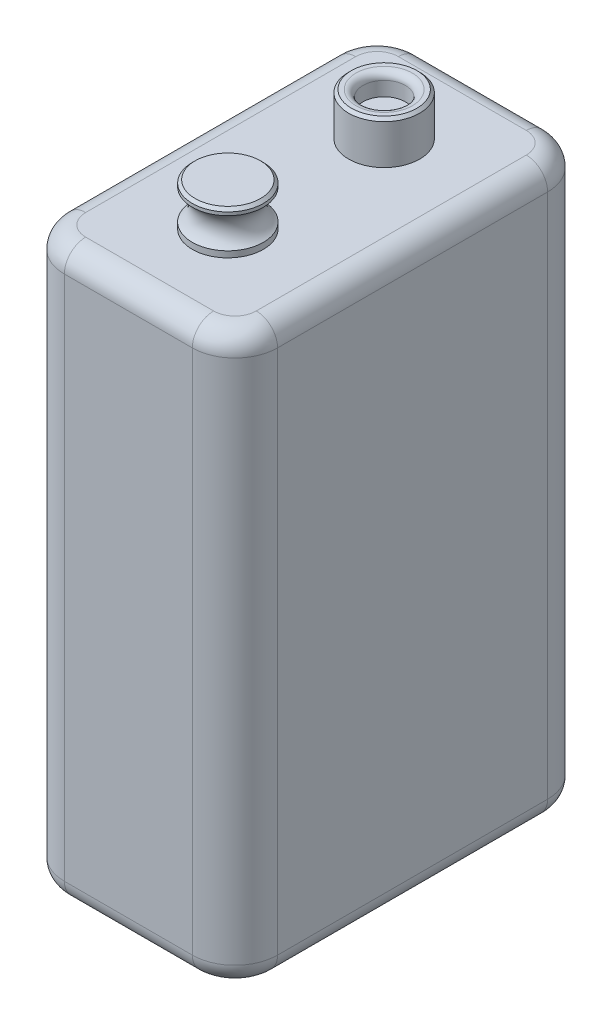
ISO-10303-21;
HEADER;
FILE_DESCRIPTION(('STEP AP214'),'2;1');
FILE_NAME('part.step','',(''),(''),'','','');
FILE_SCHEMA(('AUTOMOTIVE_DESIGN { 1 0 10303 214 1 1 1 1 }'));
ENDSEC;
DATA;
#1=APPLICATION_CONTEXT('core data for automotive mechanical design processes');
#2=APPLICATION_PROTOCOL_DEFINITION('international standard','automotive_design',2000,#1);
#3=PRODUCT_CONTEXT('',#1,'mechanical');
#4=PRODUCT('Part','Part','',(#3));
#5=PRODUCT_RELATED_PRODUCT_CATEGORY('part','',(#4));
#6=PRODUCT_DEFINITION_FORMATION('','',#4);
#7=PRODUCT_DEFINITION_CONTEXT('part definition',#1,'design');
#8=PRODUCT_DEFINITION('design','',#6,#7);
#9=PRODUCT_DEFINITION_SHAPE('','',#8);
#10=(LENGTH_UNIT() NAMED_UNIT(*) SI_UNIT(.MILLI.,.METRE.));
#11=(NAMED_UNIT(*) PLANE_ANGLE_UNIT() SI_UNIT($,.RADIAN.));
#12=(NAMED_UNIT(*) SI_UNIT($,.STERADIAN.) SOLID_ANGLE_UNIT());
#13=UNCERTAINTY_MEASURE_WITH_UNIT(LENGTH_MEASURE(1.E-05),#10,'distance_accuracy_value','');
#14=(GEOMETRIC_REPRESENTATION_CONTEXT(3) GLOBAL_UNCERTAINTY_ASSIGNED_CONTEXT((#13)) GLOBAL_UNIT_ASSIGNED_CONTEXT((#10,
#11,#12)) REPRESENTATION_CONTEXT('',''));
#15=CARTESIAN_POINT('',(0.,0.,0.));
#16=DIRECTION('',(0.,0.,1.));
#17=DIRECTION('',(1.,0.,0.));
#18=AXIS2_PLACEMENT_3D('',#15,#16,#17);
#19=CARTESIAN_POINT('',(0.,43.,5.49999999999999));
#20=DIRECTION('',(0.,-1.,0.));
#21=DIRECTION('',(0.,0.,-1.));
#22=AXIS2_PLACEMENT_3D('',#19,#20,#21);
#23=CYLINDRICAL_SURFACE('',#22,2.5);
#24=CARTESIAN_POINT('',(0.,40.,5.49999999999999));
#25=DIRECTION('',(0.,1.,0.));
#26=DIRECTION('',(0.,0.,-1.));
#27=AXIS2_PLACEMENT_3D('',#24,#25,#26);
#28=CIRCLE('',#27,2.5);
#29=CARTESIAN_POINT('',(0.,40.,2.99999999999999));
#30=VERTEX_POINT('',#29);
#31=EDGE_CURVE('E461',#30,#30,#28,.T.);
#32=ORIENTED_EDGE('',*,*,#31,.T.);
#33=EDGE_LOOP('',(#32));
#34=FACE_BOUND('',#33,.T.);
#35=CARTESIAN_POINT('',(0.,40.4314612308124,5.49999999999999));
#36=DIRECTION('',(0.,1.,0.));
#37=DIRECTION('',(0.,0.,1.));
#38=AXIS2_PLACEMENT_3D('',#35,#36,#37);
#39=CIRCLE('',#38,2.5);
#40=CARTESIAN_POINT('',(0.,40.4314612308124,7.99999999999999));
#41=VERTEX_POINT('',#40);
#42=EDGE_CURVE('E301',#41,#41,#39,.T.);
#43=ORIENTED_EDGE('',*,*,#42,.F.);
#44=EDGE_LOOP('',(#43));
#45=FACE_BOUND('',#44,.T.);
#46=ADVANCED_FACE('F41',(#34,#45),#23,.T.);
#47=CARTESIAN_POINT('',(7.5,40.,-12.5));
#48=DIRECTION('',(-1.,0.,0.));
#49=DIRECTION('',(0.,0.,1.));
#50=AXIS2_PLACEMENT_3D('',#47,#48,#49);
#51=PLANE('',#50);
#52=DIRECTION('',(0.,-1.,0.));
#53=VECTOR('',#52,1.);
#54=CARTESIAN_POINT('',(7.5,40.,-9.50000000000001));
#55=LINE('',#54,#53);
#56=CARTESIAN_POINT('',(7.5,1.5,-9.50000000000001));
#57=VERTEX_POINT('',#56);
#58=CARTESIAN_POINT('',(7.5,38.5,-9.50000000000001));
#59=VERTEX_POINT('',#58);
#60=EDGE_CURVE('E477',#57,#59,#55,.F.);
#61=ORIENTED_EDGE('',*,*,#60,.T.);
#62=DIRECTION('',(0.,0.,-1.));
#63=VECTOR('',#62,1.);
#64=CARTESIAN_POINT('',(7.5,38.5,9.49999999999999));
#65=LINE('',#64,#63);
#66=CARTESIAN_POINT('',(7.5,38.5,9.49999999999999));
#67=VERTEX_POINT('',#66);
#68=EDGE_CURVE('E265',#59,#67,#65,.F.);
#69=ORIENTED_EDGE('',*,*,#68,.T.);
#70=DIRECTION('',(0.,-1.,0.));
#71=VECTOR('',#70,1.);
#72=CARTESIAN_POINT('',(7.5,40.,9.49999999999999));
#73=LINE('',#72,#71);
#74=CARTESIAN_POINT('',(7.5,1.5,9.49999999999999));
#75=VERTEX_POINT('',#74);
#76=EDGE_CURVE('E475',#67,#75,#73,.T.);
#77=ORIENTED_EDGE('',*,*,#76,.T.);
#78=DIRECTION('',(0.,0.,-1.));
#79=VECTOR('',#78,1.);
#80=CARTESIAN_POINT('',(7.5,1.5,-12.5));
#81=LINE('',#80,#79);
#82=EDGE_CURVE('E216',#75,#57,#81,.T.);
#83=ORIENTED_EDGE('',*,*,#82,.T.);
#84=EDGE_LOOP('',(#61,#69,#77,#83));
#85=FACE_BOUND('',#84,.T.);
#86=ADVANCED_FACE('F322',(#85),#51,.F.);
#87=CARTESIAN_POINT('',(-7.5,40.,-12.5));
#88=DIRECTION('',(0.,0.,1.));
#89=DIRECTION('',(1.,0.,0.));
#90=AXIS2_PLACEMENT_3D('',#87,#88,#89);
#91=PLANE('',#90);
#92=DIRECTION('',(0.,-1.,0.));
#93=VECTOR('',#92,1.);
#94=CARTESIAN_POINT('',(-4.5,40.,-12.5));
#95=LINE('',#94,#93);
#96=CARTESIAN_POINT('',(-4.5,1.5,-12.5));
#97=VERTEX_POINT('',#96);
#98=CARTESIAN_POINT('',(-4.5,38.5,-12.5));
#99=VERTEX_POINT('',#98);
#100=EDGE_CURVE('E473',#97,#99,#95,.F.);
#101=ORIENTED_EDGE('',*,*,#100,.T.);
#102=DIRECTION('',(-1.,0.,0.));
#103=VECTOR('',#102,1.);
#104=CARTESIAN_POINT('',(4.5,38.5,-12.5));
#105=LINE('',#104,#103);
#106=CARTESIAN_POINT('',(4.5,38.5,-12.5));
#107=VERTEX_POINT('',#106);
#108=EDGE_CURVE('E64',#99,#107,#105,.F.);
#109=ORIENTED_EDGE('',*,*,#108,.T.);
#110=DIRECTION('',(0.,-1.,0.));
#111=VECTOR('',#110,1.);
#112=CARTESIAN_POINT('',(4.5,40.,-12.5));
#113=LINE('',#112,#111);
#114=CARTESIAN_POINT('',(4.5,1.5,-12.5));
#115=VERTEX_POINT('',#114);
#116=EDGE_CURVE('E471',#107,#115,#113,.T.);
#117=ORIENTED_EDGE('',*,*,#116,.T.);
#118=DIRECTION('',(-1.,0.,0.));
#119=VECTOR('',#118,1.);
#120=CARTESIAN_POINT('',(-7.5,1.5,-12.5));
#121=LINE('',#120,#119);
#122=EDGE_CURVE('E213',#115,#97,#121,.T.);
#123=ORIENTED_EDGE('',*,*,#122,.T.);
#124=EDGE_LOOP('',(#101,#109,#117,#123));
#125=FACE_BOUND('',#124,.T.);
#126=ADVANCED_FACE('F327',(#125),#91,.F.);
#127=CARTESIAN_POINT('',(-7.5,40.,-12.5));
#128=DIRECTION('',(1.,0.,0.));
#129=DIRECTION('',(0.,0.,-1.));
#130=AXIS2_PLACEMENT_3D('',#127,#128,#129);
#131=PLANE('',#130);
#132=DIRECTION('',(0.,-1.,0.));
#133=VECTOR('',#132,1.);
#134=CARTESIAN_POINT('',(-7.5,40.,9.49999999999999));
#135=LINE('',#134,#133);
#136=CARTESIAN_POINT('',(-7.5,1.5,9.49999999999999));
#137=VERTEX_POINT('',#136);
#138=CARTESIAN_POINT('',(-7.5,38.5,9.49999999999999));
#139=VERTEX_POINT('',#138);
#140=EDGE_CURVE('E235',#137,#139,#135,.F.);
#141=ORIENTED_EDGE('',*,*,#140,.T.);
#142=DIRECTION('',(0.,0.,1.));
#143=VECTOR('',#142,1.);
#144=CARTESIAN_POINT('',(-7.5,38.5,-9.50000000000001));
#145=LINE('',#144,#143);
#146=CARTESIAN_POINT('',(-7.5,38.5,-9.50000000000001));
#147=VERTEX_POINT('',#146);
#148=EDGE_CURVE('E259',#139,#147,#145,.F.);
#149=ORIENTED_EDGE('',*,*,#148,.T.);
#150=DIRECTION('',(0.,-1.,0.));
#151=VECTOR('',#150,1.);
#152=CARTESIAN_POINT('',(-7.5,40.,-9.50000000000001));
#153=LINE('',#152,#151);
#154=CARTESIAN_POINT('',(-7.5,1.5,-9.50000000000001));
#155=VERTEX_POINT('',#154);
#156=EDGE_CURVE('E469',#147,#155,#153,.T.);
#157=ORIENTED_EDGE('',*,*,#156,.T.);
#158=DIRECTION('',(0.,0.,1.));
#159=VECTOR('',#158,1.);
#160=CARTESIAN_POINT('',(-7.5,1.5,-12.5));
#161=LINE('',#160,#159);
#162=EDGE_CURVE('E208',#155,#137,#161,.T.);
#163=ORIENTED_EDGE('',*,*,#162,.T.);
#164=EDGE_LOOP('',(#141,#149,#157,#163));
#165=FACE_BOUND('',#164,.T.);
#166=ADVANCED_FACE('F355',(#165),#131,.F.);
#167=CARTESIAN_POINT('',(-7.5,40.,12.5));
#168=DIRECTION('',(0.,0.,-1.));
#169=DIRECTION('',(-1.,0.,0.));
#170=AXIS2_PLACEMENT_3D('',#167,#168,#169);
#171=PLANE('',#170);
#172=DIRECTION('',(0.,-1.,0.));
#173=VECTOR('',#172,1.);
#174=CARTESIAN_POINT('',(4.5,40.,12.5));
#175=LINE('',#174,#173);
#176=CARTESIAN_POINT('',(4.5,1.5,12.5));
#177=VERTEX_POINT('',#176);
#178=CARTESIAN_POINT('',(4.5,38.5,12.5));
#179=VERTEX_POINT('',#178);
#180=EDGE_CURVE('E185',#177,#179,#175,.F.);
#181=ORIENTED_EDGE('',*,*,#180,.T.);
#182=DIRECTION('',(1.,0.,0.));
#183=VECTOR('',#182,1.);
#184=CARTESIAN_POINT('',(-4.5,38.5,12.5));
#185=LINE('',#184,#183);
#186=CARTESIAN_POINT('',(-4.5,38.5,12.5));
#187=VERTEX_POINT('',#186);
#188=EDGE_CURVE('E255',#179,#187,#185,.F.);
#189=ORIENTED_EDGE('',*,*,#188,.T.);
#190=DIRECTION('',(0.,-1.,0.));
#191=VECTOR('',#190,1.);
#192=CARTESIAN_POINT('',(-4.5,40.,12.5));
#193=LINE('',#192,#191);
#194=CARTESIAN_POINT('',(-4.5,1.5,12.5));
#195=VERTEX_POINT('',#194);
#196=EDGE_CURVE('E183',#187,#195,#193,.T.);
#197=ORIENTED_EDGE('',*,*,#196,.T.);
#198=DIRECTION('',(1.,0.,0.));
#199=VECTOR('',#198,1.);
#200=CARTESIAN_POINT('',(-7.5,1.5,12.5));
#201=LINE('',#200,#199);
#202=EDGE_CURVE('E203',#195,#177,#201,.T.);
#203=ORIENTED_EDGE('',*,*,#202,.T.);
#204=EDGE_LOOP('',(#181,#189,#197,#203));
#205=FACE_BOUND('',#204,.T.);
#206=ADVANCED_FACE('F348',(#205),#171,.F.);
#207=CARTESIAN_POINT('',(0.,40.,0.));
#208=DIRECTION('',(0.,1.,0.));
#209=DIRECTION('',(0.,0.,1.));
#210=AXIS2_PLACEMENT_3D('',#207,#208,#209);
#211=PLANE('',#210);
#212=ORIENTED_EDGE('',*,*,#31,.F.);
#213=EDGE_LOOP('',(#212));
#214=FACE_BOUND('',#213,.T.);
#215=CARTESIAN_POINT('',(0.,40.,-5.5));
#216=DIRECTION('',(0.,1.,0.));
#217=DIRECTION('',(0.,0.,1.));
#218=AXIS2_PLACEMENT_3D('',#215,#216,#217);
#219=CIRCLE('',#218,2.5);
#220=CARTESIAN_POINT('',(0.,40.,-3.));
#221=VERTEX_POINT('',#220);
#222=EDGE_CURVE('E271',#221,#221,#219,.T.);
#223=ORIENTED_EDGE('',*,*,#222,.F.);
#224=EDGE_LOOP('',(#223));
#225=FACE_BOUND('',#224,.T.);
#226=DIRECTION('',(1.,0.,0.));
#227=VECTOR('',#226,1.);
#228=CARTESIAN_POINT('',(4.5,40.,11.));
#229=LINE('',#228,#227);
#230=CARTESIAN_POINT('',(-4.5,40.,11.));
#231=VERTEX_POINT('',#230);
#232=CARTESIAN_POINT('',(4.5,40.,11.));
#233=VERTEX_POINT('',#232);
#234=EDGE_CURVE('E247',#231,#233,#229,.T.);
#235=ORIENTED_EDGE('',*,*,#234,.T.);
#236=CARTESIAN_POINT('',(4.5,40.,9.49999999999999));
#237=DIRECTION('',(0.,1.,0.));
#238=DIRECTION('',(0.,0.,1.));
#239=AXIS2_PLACEMENT_3D('',#236,#237,#238);
#240=CIRCLE('',#239,1.5);
#241=CARTESIAN_POINT('',(6.,40.,9.49999999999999));
#242=VERTEX_POINT('',#241);
#243=EDGE_CURVE('E249',#233,#242,#240,.T.);
#244=ORIENTED_EDGE('',*,*,#243,.T.);
#245=DIRECTION('',(0.,0.,-1.));
#246=VECTOR('',#245,1.);
#247=CARTESIAN_POINT('',(6.,40.,-9.50000000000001));
#248=LINE('',#247,#246);
#249=CARTESIAN_POINT('',(6.,40.,-9.50000000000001));
#250=VERTEX_POINT('',#249);
#251=EDGE_CURVE('E218',#242,#250,#248,.T.);
#252=ORIENTED_EDGE('',*,*,#251,.T.);
#253=CARTESIAN_POINT('',(4.5,40.,-9.50000000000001));
#254=DIRECTION('',(0.,1.,0.));
#255=DIRECTION('',(0.,0.,1.));
#256=AXIS2_PLACEMENT_3D('',#253,#254,#255);
#257=CIRCLE('',#256,1.5);
#258=CARTESIAN_POINT('',(4.5,40.,-11.));
#259=VERTEX_POINT('',#258);
#260=EDGE_CURVE('E237',#250,#259,#257,.T.);
#261=ORIENTED_EDGE('',*,*,#260,.T.);
#262=DIRECTION('',(-1.,0.,0.));
#263=VECTOR('',#262,1.);
#264=CARTESIAN_POINT('',(-4.5,40.,-11.));
#265=LINE('',#264,#263);
#266=CARTESIAN_POINT('',(-4.5,40.,-11.));
#267=VERTEX_POINT('',#266);
#268=EDGE_CURVE('E239',#259,#267,#265,.T.);
#269=ORIENTED_EDGE('',*,*,#268,.T.);
#270=CARTESIAN_POINT('',(-4.5,40.,-9.50000000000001));
#271=DIRECTION('',(0.,1.,0.));
#272=DIRECTION('',(0.,0.,1.));
#273=AXIS2_PLACEMENT_3D('',#270,#271,#272);
#274=CIRCLE('',#273,1.5);
#275=CARTESIAN_POINT('',(-6.,40.,-9.50000000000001));
#276=VERTEX_POINT('',#275);
#277=EDGE_CURVE('E241',#267,#276,#274,.T.);
#278=ORIENTED_EDGE('',*,*,#277,.T.);
#279=DIRECTION('',(0.,0.,1.));
#280=VECTOR('',#279,1.);
#281=CARTESIAN_POINT('',(-6.,40.,9.49999999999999));
#282=LINE('',#281,#280);
#283=CARTESIAN_POINT('',(-6.,40.,9.49999999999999));
#284=VERTEX_POINT('',#283);
#285=EDGE_CURVE('E243',#276,#284,#282,.T.);
#286=ORIENTED_EDGE('',*,*,#285,.T.);
#287=CARTESIAN_POINT('',(-4.5,40.,9.49999999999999));
#288=DIRECTION('',(0.,1.,0.));
#289=DIRECTION('',(0.,0.,1.));
#290=AXIS2_PLACEMENT_3D('',#287,#288,#289);
#291=CIRCLE('',#290,1.5);
#292=EDGE_CURVE('E245',#284,#231,#291,.T.);
#293=ORIENTED_EDGE('',*,*,#292,.T.);
#294=EDGE_LOOP('',(#235,#244,#252,#261,#269,#278,#286,#293));
#295=FACE_BOUND('',#294,.T.);
#296=ADVANCED_FACE('F345',(#214,#225,#295),#211,.T.);
#297=CARTESIAN_POINT('',(0.,0.,0.));
#298=DIRECTION('',(0.,1.,0.));
#299=DIRECTION('',(0.,0.,1.));
#300=AXIS2_PLACEMENT_3D('',#297,#298,#299);
#301=PLANE('',#300);
#302=DIRECTION('',(0.,0.,-1.));
#303=VECTOR('',#302,1.);
#304=CARTESIAN_POINT('',(6.,0.,0.));
#305=LINE('',#304,#303);
#306=CARTESIAN_POINT('',(6.,0.,-9.50000000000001));
#307=VERTEX_POINT('',#306);
#308=CARTESIAN_POINT('',(6.,0.,9.49999999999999));
#309=VERTEX_POINT('',#308);
#310=EDGE_CURVE('E160',#307,#309,#305,.F.);
#311=ORIENTED_EDGE('',*,*,#310,.T.);
#312=CARTESIAN_POINT('',(4.5,0.,9.49999999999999));
#313=DIRECTION('',(0.,1.,0.));
#314=DIRECTION('',(0.,0.,1.));
#315=AXIS2_PLACEMENT_3D('',#312,#313,#314);
#316=CIRCLE('',#315,1.5);
#317=CARTESIAN_POINT('',(4.5,0.,11.));
#318=VERTEX_POINT('',#317);
#319=EDGE_CURVE('E198',#309,#318,#316,.F.);
#320=ORIENTED_EDGE('',*,*,#319,.T.);
#321=DIRECTION('',(1.,0.,0.));
#322=VECTOR('',#321,1.);
#323=CARTESIAN_POINT('',(0.,0.,11.));
#324=LINE('',#323,#322);
#325=CARTESIAN_POINT('',(-4.5,0.,11.));
#326=VERTEX_POINT('',#325);
#327=EDGE_CURVE('E196',#318,#326,#324,.F.);
#328=ORIENTED_EDGE('',*,*,#327,.T.);
#329=CARTESIAN_POINT('',(-4.5,0.,9.49999999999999));
#330=DIRECTION('',(0.,1.,0.));
#331=DIRECTION('',(0.,0.,1.));
#332=AXIS2_PLACEMENT_3D('',#329,#330,#331);
#333=CIRCLE('',#332,1.5);
#334=CARTESIAN_POINT('',(-6.,0.,9.49999999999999));
#335=VERTEX_POINT('',#334);
#336=EDGE_CURVE('E194',#326,#335,#333,.F.);
#337=ORIENTED_EDGE('',*,*,#336,.T.);
#338=DIRECTION('',(0.,0.,1.));
#339=VECTOR('',#338,1.);
#340=CARTESIAN_POINT('',(-6.,0.,0.));
#341=LINE('',#340,#339);
#342=CARTESIAN_POINT('',(-6.,0.,-9.50000000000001));
#343=VERTEX_POINT('',#342);
#344=EDGE_CURVE('E192',#335,#343,#341,.F.);
#345=ORIENTED_EDGE('',*,*,#344,.T.);
#346=CARTESIAN_POINT('',(-4.5,0.,-9.50000000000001));
#347=DIRECTION('',(0.,1.,0.));
#348=DIRECTION('',(0.,0.,1.));
#349=AXIS2_PLACEMENT_3D('',#346,#347,#348);
#350=CIRCLE('',#349,1.5);
#351=CARTESIAN_POINT('',(-4.5,0.,-11.));
#352=VERTEX_POINT('',#351);
#353=EDGE_CURVE('E190',#343,#352,#350,.F.);
#354=ORIENTED_EDGE('',*,*,#353,.T.);
#355=DIRECTION('',(-1.,0.,0.));
#356=VECTOR('',#355,1.);
#357=CARTESIAN_POINT('',(0.,0.,-11.));
#358=LINE('',#357,#356);
#359=CARTESIAN_POINT('',(4.5,0.,-11.));
#360=VERTEX_POINT('',#359);
#361=EDGE_CURVE('E163',#352,#360,#358,.F.);
#362=ORIENTED_EDGE('',*,*,#361,.T.);
#363=CARTESIAN_POINT('',(4.5,0.,-9.50000000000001));
#364=DIRECTION('',(0.,1.,0.));
#365=DIRECTION('',(0.,0.,1.));
#366=AXIS2_PLACEMENT_3D('',#363,#364,#365);
#367=CIRCLE('',#366,1.5);
#368=EDGE_CURVE('E155',#360,#307,#367,.F.);
#369=ORIENTED_EDGE('',*,*,#368,.T.);
#370=EDGE_LOOP('',(#311,#320,#328,#337,#345,#354,#362,#369));
#371=FACE_BOUND('',#370,.T.);
#372=ADVANCED_FACE('F157',(#371),#301,.F.);
#373=CARTESIAN_POINT('',(-4.5,40.,-9.50000000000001));
#374=DIRECTION('',(0.,-1.,0.));
#375=DIRECTION('',(0.,0.,-1.));
#376=AXIS2_PLACEMENT_3D('',#373,#374,#375);
#377=CYLINDRICAL_SURFACE('',#376,3.);
#378=ORIENTED_EDGE('',*,*,#156,.F.);
#379=CARTESIAN_POINT('',(-4.5,38.5,-9.50000000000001));
#380=DIRECTION('',(0.,1.,0.));
#381=DIRECTION('',(0.,0.,1.));
#382=AXIS2_PLACEMENT_3D('',#379,#380,#381);
#383=CIRCLE('',#382,3.);
#384=EDGE_CURVE('E261',#147,#99,#383,.F.);
#385=ORIENTED_EDGE('',*,*,#384,.T.);
#386=ORIENTED_EDGE('',*,*,#100,.F.);
#387=CARTESIAN_POINT('',(-4.5,1.5,-9.50000000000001));
#388=DIRECTION('',(0.,1.,0.));
#389=DIRECTION('',(0.,0.,1.));
#390=AXIS2_PLACEMENT_3D('',#387,#388,#389);
#391=CIRCLE('',#390,3.);
#392=EDGE_CURVE('E210',#97,#155,#391,.T.);
#393=ORIENTED_EDGE('',*,*,#392,.T.);
#394=EDGE_LOOP('',(#378,#385,#386,#393));
#395=FACE_BOUND('',#394,.T.);
#396=ADVANCED_FACE('F352',(#395),#377,.T.);
#397=CARTESIAN_POINT('',(4.5,40.,-9.50000000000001));
#398=DIRECTION('',(0.,-1.,0.));
#399=DIRECTION('',(0.,0.,-1.));
#400=AXIS2_PLACEMENT_3D('',#397,#398,#399);
#401=CYLINDRICAL_SURFACE('',#400,3.);
#402=ORIENTED_EDGE('',*,*,#116,.F.);
#403=CARTESIAN_POINT('',(4.5,38.5,-9.50000000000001));
#404=DIRECTION('',(0.,1.,0.));
#405=DIRECTION('',(0.,0.,1.));
#406=AXIS2_PLACEMENT_3D('',#403,#404,#405);
#407=CIRCLE('',#406,3.);
#408=EDGE_CURVE('E56',#107,#59,#407,.F.);
#409=ORIENTED_EDGE('',*,*,#408,.T.);
#410=ORIENTED_EDGE('',*,*,#60,.F.);
#411=CARTESIAN_POINT('',(4.5,1.5,-9.50000000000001));
#412=DIRECTION('',(0.,1.,0.));
#413=DIRECTION('',(0.,0.,1.));
#414=AXIS2_PLACEMENT_3D('',#411,#412,#413);
#415=CIRCLE('',#414,3.);
#416=EDGE_CURVE('E173',#57,#115,#415,.T.);
#417=ORIENTED_EDGE('',*,*,#416,.T.);
#418=EDGE_LOOP('',(#402,#409,#410,#417));
#419=FACE_BOUND('',#418,.T.);
#420=ADVANCED_FACE('F364',(#419),#401,.T.);
#421=CARTESIAN_POINT('',(-4.5,40.,9.49999999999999));
#422=DIRECTION('',(0.,-1.,0.));
#423=DIRECTION('',(0.,0.,-1.));
#424=AXIS2_PLACEMENT_3D('',#421,#422,#423);
#425=CYLINDRICAL_SURFACE('',#424,3.);
#426=ORIENTED_EDGE('',*,*,#196,.F.);
#427=CARTESIAN_POINT('',(-4.5,38.5,9.49999999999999));
#428=DIRECTION('',(0.,1.,0.));
#429=DIRECTION('',(0.,0.,1.));
#430=AXIS2_PLACEMENT_3D('',#427,#428,#429);
#431=CIRCLE('',#430,3.);
#432=EDGE_CURVE('E257',#187,#139,#431,.F.);
#433=ORIENTED_EDGE('',*,*,#432,.T.);
#434=ORIENTED_EDGE('',*,*,#140,.F.);
#435=CARTESIAN_POINT('',(-4.5,1.5,9.49999999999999));
#436=DIRECTION('',(0.,1.,0.));
#437=DIRECTION('',(0.,0.,1.));
#438=AXIS2_PLACEMENT_3D('',#435,#436,#437);
#439=CIRCLE('',#438,3.);
#440=EDGE_CURVE('E205',#137,#195,#439,.T.);
#441=ORIENTED_EDGE('',*,*,#440,.T.);
#442=EDGE_LOOP('',(#426,#433,#434,#441));
#443=FACE_BOUND('',#442,.T.);
#444=ADVANCED_FACE('F368',(#443),#425,.T.);
#445=CARTESIAN_POINT('',(4.5,40.,9.49999999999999));
#446=DIRECTION('',(0.,-1.,0.));
#447=DIRECTION('',(0.,0.,-1.));
#448=AXIS2_PLACEMENT_3D('',#445,#446,#447);
#449=CYLINDRICAL_SURFACE('',#448,3.);
#450=ORIENTED_EDGE('',*,*,#76,.F.);
#451=CARTESIAN_POINT('',(4.5,38.5,9.49999999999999));
#452=DIRECTION('',(0.,1.,0.));
#453=DIRECTION('',(0.,0.,1.));
#454=AXIS2_PLACEMENT_3D('',#451,#452,#453);
#455=CIRCLE('',#454,3.);
#456=EDGE_CURVE('E252',#67,#179,#455,.F.);
#457=ORIENTED_EDGE('',*,*,#456,.T.);
#458=ORIENTED_EDGE('',*,*,#180,.F.);
#459=CARTESIAN_POINT('',(4.5,1.5,9.49999999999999));
#460=DIRECTION('',(0.,1.,0.));
#461=DIRECTION('',(0.,0.,1.));
#462=AXIS2_PLACEMENT_3D('',#459,#460,#461);
#463=CIRCLE('',#462,3.);
#464=EDGE_CURVE('E200',#177,#75,#463,.T.);
#465=ORIENTED_EDGE('',*,*,#464,.T.);
#466=EDGE_LOOP('',(#450,#457,#458,#465));
#467=FACE_BOUND('',#466,.T.);
#468=ADVANCED_FACE('F371',(#467),#449,.T.);
#469=CARTESIAN_POINT('',(-4.5,1.5,-9.50000000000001));
#470=DIRECTION('',(0.,1.,0.));
#471=DIRECTION('',(0.,0.,1.));
#472=AXIS2_PLACEMENT_3D('',#469,#470,#471);
#473=DEGENERATE_TOROIDAL_SURFACE('',#472,1.5,1.5,.T.);
#474=CARTESIAN_POINT('',(-6.,1.5,-9.50000000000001));
#475=DIRECTION('',(0.,0.,1.));
#476=DIRECTION('',(1.,0.,0.));
#477=AXIS2_PLACEMENT_3D('',#474,#475,#476);
#478=CIRCLE('',#477,1.5);
#479=EDGE_CURVE('E229',#155,#343,#478,.T.);
#480=ORIENTED_EDGE('',*,*,#479,.F.);
#481=ORIENTED_EDGE('',*,*,#392,.F.);
#482=CARTESIAN_POINT('',(-4.5,1.5,-11.));
#483=DIRECTION('',(1.,0.,0.));
#484=DIRECTION('',(0.,0.,-1.));
#485=AXIS2_PLACEMENT_3D('',#482,#483,#484);
#486=CIRCLE('',#485,1.5);
#487=EDGE_CURVE('E232',#352,#97,#486,.T.);
#488=ORIENTED_EDGE('',*,*,#487,.F.);
#489=ORIENTED_EDGE('',*,*,#353,.F.);
#490=EDGE_LOOP('',(#480,#481,#488,#489));
#491=FACE_BOUND('',#490,.T.);
#492=ADVANCED_FACE('F375',(#491),#473,.T.);
#493=CARTESIAN_POINT('',(-7.5,1.5,-11.));
#494=DIRECTION('',(-1.,0.,0.));
#495=DIRECTION('',(0.,0.,1.));
#496=AXIS2_PLACEMENT_3D('',#493,#494,#495);
#497=CYLINDRICAL_SURFACE('',#496,1.5);
#498=ORIENTED_EDGE('',*,*,#487,.T.);
#499=ORIENTED_EDGE('',*,*,#122,.F.);
#500=CARTESIAN_POINT('',(4.5,1.5,-11.));
#501=DIRECTION('',(1.,0.,0.));
#502=DIRECTION('',(0.,0.,-1.));
#503=AXIS2_PLACEMENT_3D('',#500,#501,#502);
#504=CIRCLE('',#503,1.5);
#505=EDGE_CURVE('E227',#360,#115,#504,.T.);
#506=ORIENTED_EDGE('',*,*,#505,.F.);
#507=ORIENTED_EDGE('',*,*,#361,.F.);
#508=EDGE_LOOP('',(#498,#499,#506,#507));
#509=FACE_BOUND('',#508,.T.);
#510=ADVANCED_FACE('F397',(#509),#497,.T.);
#511=CARTESIAN_POINT('',(-6.,1.5,-12.5));
#512=DIRECTION('',(0.,0.,1.));
#513=DIRECTION('',(1.,0.,0.));
#514=AXIS2_PLACEMENT_3D('',#511,#512,#513);
#515=CYLINDRICAL_SURFACE('',#514,1.5);
#516=ORIENTED_EDGE('',*,*,#479,.T.);
#517=ORIENTED_EDGE('',*,*,#344,.F.);
#518=CARTESIAN_POINT('',(-6.,1.5,9.49999999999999));
#519=DIRECTION('',(0.,0.,1.));
#520=DIRECTION('',(1.,0.,0.));
#521=AXIS2_PLACEMENT_3D('',#518,#519,#520);
#522=CIRCLE('',#521,1.5);
#523=EDGE_CURVE('E176',#137,#335,#522,.T.);
#524=ORIENTED_EDGE('',*,*,#523,.F.);
#525=ORIENTED_EDGE('',*,*,#162,.F.);
#526=EDGE_LOOP('',(#516,#517,#524,#525));
#527=FACE_BOUND('',#526,.T.);
#528=ADVANCED_FACE('F394',(#527),#515,.T.);
#529=CARTESIAN_POINT('',(4.5,1.5,-9.50000000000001));
#530=DIRECTION('',(0.,1.,0.));
#531=DIRECTION('',(0.,0.,1.));
#532=AXIS2_PLACEMENT_3D('',#529,#530,#531);
#533=DEGENERATE_TOROIDAL_SURFACE('',#532,1.5,1.5,.T.);
#534=ORIENTED_EDGE('',*,*,#505,.T.);
#535=ORIENTED_EDGE('',*,*,#416,.F.);
#536=CARTESIAN_POINT('',(6.,1.5,-9.50000000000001));
#537=DIRECTION('',(0.,0.,1.));
#538=DIRECTION('',(1.,0.,0.));
#539=AXIS2_PLACEMENT_3D('',#536,#537,#538);
#540=CIRCLE('',#539,1.5);
#541=EDGE_CURVE('E170',#307,#57,#540,.T.);
#542=ORIENTED_EDGE('',*,*,#541,.F.);
#543=ORIENTED_EDGE('',*,*,#368,.F.);
#544=EDGE_LOOP('',(#534,#535,#542,#543));
#545=FACE_BOUND('',#544,.T.);
#546=ADVANCED_FACE('F171',(#545),#533,.T.);
#547=CARTESIAN_POINT('',(-4.5,1.5,9.49999999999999));
#548=DIRECTION('',(0.,1.,0.));
#549=DIRECTION('',(0.,0.,1.));
#550=AXIS2_PLACEMENT_3D('',#547,#548,#549);
#551=DEGENERATE_TOROIDAL_SURFACE('',#550,1.5,1.5,.T.);
#552=ORIENTED_EDGE('',*,*,#523,.T.);
#553=ORIENTED_EDGE('',*,*,#336,.F.);
#554=CARTESIAN_POINT('',(-4.5,1.5,11.));
#555=DIRECTION('',(1.,0.,0.));
#556=DIRECTION('',(0.,0.,-1.));
#557=AXIS2_PLACEMENT_3D('',#554,#555,#556);
#558=CIRCLE('',#557,1.5);
#559=EDGE_CURVE('E177',#195,#326,#558,.T.);
#560=ORIENTED_EDGE('',*,*,#559,.F.);
#561=ORIENTED_EDGE('',*,*,#440,.F.);
#562=EDGE_LOOP('',(#552,#553,#560,#561));
#563=FACE_BOUND('',#562,.T.);
#564=ADVANCED_FACE('F388',(#563),#551,.T.);
#565=CARTESIAN_POINT('',(6.,1.5,-12.5));
#566=DIRECTION('',(0.,0.,-1.));
#567=DIRECTION('',(-1.,0.,0.));
#568=AXIS2_PLACEMENT_3D('',#565,#566,#567);
#569=CYLINDRICAL_SURFACE('',#568,1.5);
#570=ORIENTED_EDGE('',*,*,#541,.T.);
#571=ORIENTED_EDGE('',*,*,#82,.F.);
#572=CARTESIAN_POINT('',(6.,1.5,9.49999999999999));
#573=DIRECTION('',(0.,0.,1.));
#574=DIRECTION('',(1.,0.,0.));
#575=AXIS2_PLACEMENT_3D('',#572,#573,#574);
#576=CIRCLE('',#575,1.5);
#577=EDGE_CURVE('E181',#309,#75,#576,.T.);
#578=ORIENTED_EDGE('',*,*,#577,.F.);
#579=ORIENTED_EDGE('',*,*,#310,.F.);
#580=EDGE_LOOP('',(#570,#571,#578,#579));
#581=FACE_BOUND('',#580,.T.);
#582=ADVANCED_FACE('F179',(#581),#569,.T.);
#583=CARTESIAN_POINT('',(-7.5,1.5,11.));
#584=DIRECTION('',(1.,0.,0.));
#585=DIRECTION('',(0.,0.,-1.));
#586=AXIS2_PLACEMENT_3D('',#583,#584,#585);
#587=CYLINDRICAL_SURFACE('',#586,1.5);
#588=ORIENTED_EDGE('',*,*,#559,.T.);
#589=ORIENTED_EDGE('',*,*,#327,.F.);
#590=CARTESIAN_POINT('',(4.5,1.5,11.));
#591=DIRECTION('',(1.,0.,0.));
#592=DIRECTION('',(0.,1.,0.));
#593=AXIS2_PLACEMENT_3D('',#590,#591,#592);
#594=CIRCLE('',#593,1.5);
#595=EDGE_CURVE('E219',#177,#318,#594,.T.);
#596=ORIENTED_EDGE('',*,*,#595,.F.);
#597=ORIENTED_EDGE('',*,*,#202,.F.);
#598=EDGE_LOOP('',(#588,#589,#596,#597));
#599=FACE_BOUND('',#598,.T.);
#600=ADVANCED_FACE('F381',(#599),#587,.T.);
#601=CARTESIAN_POINT('',(4.5,1.5,9.49999999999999));
#602=DIRECTION('',(0.,1.,0.));
#603=DIRECTION('',(0.,0.,1.));
#604=AXIS2_PLACEMENT_3D('',#601,#602,#603);
#605=DEGENERATE_TOROIDAL_SURFACE('',#604,1.5,1.5,.T.);
#606=ORIENTED_EDGE('',*,*,#577,.T.);
#607=ORIENTED_EDGE('',*,*,#464,.F.);
#608=ORIENTED_EDGE('',*,*,#595,.T.);
#609=ORIENTED_EDGE('',*,*,#319,.F.);
#610=EDGE_LOOP('',(#606,#607,#608,#609));
#611=FACE_BOUND('',#610,.T.);
#612=ADVANCED_FACE('F377',(#611),#605,.T.);
#613=CARTESIAN_POINT('',(-4.5,38.5,-9.50000000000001));
#614=DIRECTION('',(0.,1.,0.));
#615=DIRECTION('',(0.,0.,1.));
#616=AXIS2_PLACEMENT_3D('',#613,#614,#615);
#617=DEGENERATE_TOROIDAL_SURFACE('',#616,1.5,1.5,.T.);
#618=CARTESIAN_POINT('',(-4.5,38.5,-11.));
#619=DIRECTION('',(1.,0.,0.));
#620=DIRECTION('',(0.,0.,-1.));
#621=AXIS2_PLACEMENT_3D('',#618,#619,#620);
#622=CIRCLE('',#621,1.5);
#623=EDGE_CURVE('E285',#99,#267,#622,.T.);
#624=ORIENTED_EDGE('',*,*,#623,.F.);
#625=ORIENTED_EDGE('',*,*,#384,.F.);
#626=CARTESIAN_POINT('',(-6.,38.5,-9.50000000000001));
#627=DIRECTION('',(0.,0.,1.));
#628=DIRECTION('',(1.,0.,0.));
#629=AXIS2_PLACEMENT_3D('',#626,#627,#628);
#630=CIRCLE('',#629,1.5);
#631=EDGE_CURVE('E221',#276,#147,#630,.T.);
#632=ORIENTED_EDGE('',*,*,#631,.F.);
#633=ORIENTED_EDGE('',*,*,#277,.F.);
#634=EDGE_LOOP('',(#624,#625,#632,#633));
#635=FACE_BOUND('',#634,.T.);
#636=ADVANCED_FACE('F380',(#635),#617,.T.);
#637=CARTESIAN_POINT('',(-6.,38.5,0.));
#638=DIRECTION('',(0.,0.,-1.));
#639=DIRECTION('',(-1.,0.,0.));
#640=AXIS2_PLACEMENT_3D('',#637,#638,#639);
#641=CYLINDRICAL_SURFACE('',#640,1.5);
#642=ORIENTED_EDGE('',*,*,#631,.T.);
#643=ORIENTED_EDGE('',*,*,#148,.F.);
#644=CARTESIAN_POINT('',(-6.,38.5,9.49999999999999));
#645=DIRECTION('',(0.,0.,1.));
#646=DIRECTION('',(1.,0.,0.));
#647=AXIS2_PLACEMENT_3D('',#644,#645,#646);
#648=CIRCLE('',#647,1.5);
#649=EDGE_CURVE('E282',#284,#139,#648,.T.);
#650=ORIENTED_EDGE('',*,*,#649,.F.);
#651=ORIENTED_EDGE('',*,*,#285,.F.);
#652=EDGE_LOOP('',(#642,#643,#650,#651));
#653=FACE_BOUND('',#652,.T.);
#654=ADVANCED_FACE('F427',(#653),#641,.T.);
#655=CARTESIAN_POINT('',(0.,38.5,-11.));
#656=DIRECTION('',(1.,0.,0.));
#657=DIRECTION('',(0.,0.,-1.));
#658=AXIS2_PLACEMENT_3D('',#655,#656,#657);
#659=CYLINDRICAL_SURFACE('',#658,1.5);
#660=ORIENTED_EDGE('',*,*,#623,.T.);
#661=ORIENTED_EDGE('',*,*,#268,.F.);
#662=CARTESIAN_POINT('',(4.5,38.5,-11.));
#663=DIRECTION('',(1.,0.,0.));
#664=DIRECTION('',(0.,0.,-1.));
#665=AXIS2_PLACEMENT_3D('',#662,#663,#664);
#666=CIRCLE('',#665,1.5);
#667=EDGE_CURVE('E279',#107,#259,#666,.T.);
#668=ORIENTED_EDGE('',*,*,#667,.F.);
#669=ORIENTED_EDGE('',*,*,#108,.F.);
#670=EDGE_LOOP('',(#660,#661,#668,#669));
#671=FACE_BOUND('',#670,.T.);
#672=ADVANCED_FACE('F423',(#671),#659,.T.);
#673=CARTESIAN_POINT('',(-4.5,38.5,9.49999999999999));
#674=DIRECTION('',(0.,1.,0.));
#675=DIRECTION('',(0.,0.,1.));
#676=AXIS2_PLACEMENT_3D('',#673,#674,#675);
#677=DEGENERATE_TOROIDAL_SURFACE('',#676,1.5,1.5,.T.);
#678=ORIENTED_EDGE('',*,*,#649,.T.);
#679=ORIENTED_EDGE('',*,*,#432,.F.);
#680=CARTESIAN_POINT('',(-4.5,38.5,11.));
#681=DIRECTION('',(1.,0.,0.));
#682=DIRECTION('',(0.,0.,-1.));
#683=AXIS2_PLACEMENT_3D('',#680,#681,#682);
#684=CIRCLE('',#683,1.5);
#685=EDGE_CURVE('E276',#231,#187,#684,.T.);
#686=ORIENTED_EDGE('',*,*,#685,.F.);
#687=ORIENTED_EDGE('',*,*,#292,.F.);
#688=EDGE_LOOP('',(#678,#679,#686,#687));
#689=FACE_BOUND('',#688,.T.);
#690=ADVANCED_FACE('F419',(#689),#677,.T.);
#691=CARTESIAN_POINT('',(4.5,38.5,-9.50000000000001));
#692=DIRECTION('',(0.,1.,0.));
#693=DIRECTION('',(0.,0.,1.));
#694=AXIS2_PLACEMENT_3D('',#691,#692,#693);
#695=DEGENERATE_TOROIDAL_SURFACE('',#694,1.5,1.5,.T.);
#696=ORIENTED_EDGE('',*,*,#667,.T.);
#697=ORIENTED_EDGE('',*,*,#260,.F.);
#698=CARTESIAN_POINT('',(6.,38.5,-9.50000000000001));
#699=DIRECTION('',(0.,0.,1.));
#700=DIRECTION('',(1.,0.,0.));
#701=AXIS2_PLACEMENT_3D('',#698,#699,#700);
#702=CIRCLE('',#701,1.5);
#703=EDGE_CURVE('E273',#59,#250,#702,.T.);
#704=ORIENTED_EDGE('',*,*,#703,.F.);
#705=ORIENTED_EDGE('',*,*,#408,.F.);
#706=EDGE_LOOP('',(#696,#697,#704,#705));
#707=FACE_BOUND('',#706,.T.);
#708=ADVANCED_FACE('F415',(#707),#695,.T.);
#709=CARTESIAN_POINT('',(0.,38.5,11.));
#710=DIRECTION('',(-1.,0.,0.));
#711=DIRECTION('',(0.,0.,1.));
#712=AXIS2_PLACEMENT_3D('',#709,#710,#711);
#713=CYLINDRICAL_SURFACE('',#712,1.5);
#714=ORIENTED_EDGE('',*,*,#685,.T.);
#715=ORIENTED_EDGE('',*,*,#188,.F.);
#716=CARTESIAN_POINT('',(4.5,38.5,11.));
#717=DIRECTION('',(1.,0.,0.));
#718=DIRECTION('',(0.,0.,-1.));
#719=AXIS2_PLACEMENT_3D('',#716,#717,#718);
#720=CIRCLE('',#719,1.5);
#721=EDGE_CURVE('E270',#233,#179,#720,.T.);
#722=ORIENTED_EDGE('',*,*,#721,.F.);
#723=ORIENTED_EDGE('',*,*,#234,.F.);
#724=EDGE_LOOP('',(#714,#715,#722,#723));
#725=FACE_BOUND('',#724,.T.);
#726=ADVANCED_FACE('F411',(#725),#713,.T.);
#727=CARTESIAN_POINT('',(6.,38.5,0.));
#728=DIRECTION('',(0.,0.,1.));
#729=DIRECTION('',(1.,0.,0.));
#730=AXIS2_PLACEMENT_3D('',#727,#728,#729);
#731=CYLINDRICAL_SURFACE('',#730,1.5);
#732=ORIENTED_EDGE('',*,*,#703,.T.);
#733=ORIENTED_EDGE('',*,*,#251,.F.);
#734=CARTESIAN_POINT('',(6.,38.5,9.49999999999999));
#735=DIRECTION('',(0.,0.,1.));
#736=DIRECTION('',(1.,0.,0.));
#737=AXIS2_PLACEMENT_3D('',#734,#735,#736);
#738=CIRCLE('',#737,1.5);
#739=EDGE_CURVE('E268',#67,#242,#738,.T.);
#740=ORIENTED_EDGE('',*,*,#739,.F.);
#741=ORIENTED_EDGE('',*,*,#68,.F.);
#742=EDGE_LOOP('',(#732,#733,#740,#741));
#743=FACE_BOUND('',#742,.T.);
#744=ADVANCED_FACE('F407',(#743),#731,.T.);
#745=CARTESIAN_POINT('',(4.5,38.5,9.49999999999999));
#746=DIRECTION('',(0.,1.,0.));
#747=DIRECTION('',(0.,0.,1.));
#748=AXIS2_PLACEMENT_3D('',#745,#746,#747);
#749=DEGENERATE_TOROIDAL_SURFACE('',#748,1.5,1.5,.T.);
#750=ORIENTED_EDGE('',*,*,#721,.T.);
#751=ORIENTED_EDGE('',*,*,#456,.F.);
#752=ORIENTED_EDGE('',*,*,#739,.T.);
#753=ORIENTED_EDGE('',*,*,#243,.F.);
#754=EDGE_LOOP('',(#750,#751,#752,#753));
#755=FACE_BOUND('',#754,.T.);
#756=ADVANCED_FACE('F343',(#755),#749,.T.);
#757=CARTESIAN_POINT('',(0.,43.,-5.5));
#758=DIRECTION('',(0.,-1.,0.));
#759=DIRECTION('',(0.,0.,-1.));
#760=AXIS2_PLACEMENT_3D('',#757,#758,#759);
#761=CYLINDRICAL_SURFACE('',#760,2.5);
#762=CARTESIAN_POINT('',(0.,42.8,-5.5));
#763=DIRECTION('',(0.,1.,0.));
#764=DIRECTION('',(0.,0.,1.));
#765=AXIS2_PLACEMENT_3D('',#762,#763,#764);
#766=CIRCLE('',#765,2.5);
#767=CARTESIAN_POINT('',(0.,42.8,-3.));
#768=VERTEX_POINT('',#767);
#769=EDGE_CURVE('E298',#768,#768,#766,.F.);
#770=ORIENTED_EDGE('',*,*,#769,.T.);
#771=EDGE_LOOP('',(#770));
#772=FACE_BOUND('',#771,.T.);
#773=ORIENTED_EDGE('',*,*,#222,.T.);
#774=EDGE_LOOP('',(#773));
#775=FACE_BOUND('',#774,.T.);
#776=ADVANCED_FACE('F339',(#772,#775),#761,.T.);
#777=CARTESIAN_POINT('',(0.,43.,-5.5));
#778=DIRECTION('',(0.,1.,0.));
#779=DIRECTION('',(0.,0.,1.));
#780=AXIS2_PLACEMENT_3D('',#777,#778,#779);
#781=PLANE('',#780);
#782=CARTESIAN_POINT('',(0.,43.,-5.5));
#783=DIRECTION('',(0.,1.,0.));
#784=DIRECTION('',(0.,0.,1.));
#785=AXIS2_PLACEMENT_3D('',#782,#783,#784);
#786=CIRCLE('',#785,2.30000000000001);
#787=CARTESIAN_POINT('',(0.,43.,-3.19999999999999));
#788=VERTEX_POINT('',#787);
#789=EDGE_CURVE('E295',#788,#788,#786,.T.);
#790=ORIENTED_EDGE('',*,*,#789,.T.);
#791=EDGE_LOOP('',(#790));
#792=FACE_BOUND('',#791,.T.);
#793=CARTESIAN_POINT('',(0.,43.,-5.5));
#794=DIRECTION('',(0.,1.,0.));
#795=DIRECTION('',(0.,0.,1.));
#796=AXIS2_PLACEMENT_3D('',#793,#794,#795);
#797=CIRCLE('',#796,1.98740320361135);
#798=CARTESIAN_POINT('',(0.,43.,-3.51259679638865));
#799=VERTEX_POINT('',#798);
#800=EDGE_CURVE('E292',#799,#799,#797,.F.);
#801=ORIENTED_EDGE('',*,*,#800,.T.);
#802=EDGE_LOOP('',(#801));
#803=FACE_BOUND('',#802,.T.);
#804=ADVANCED_FACE('F335',(#792,#803),#781,.T.);
#805=CARTESIAN_POINT('',(0.,41.5,-5.5));
#806=DIRECTION('',(0.,1.,0.));
#807=DIRECTION('',(0.,0.,1.));
#808=AXIS2_PLACEMENT_3D('',#805,#806,#807);
#809=CYLINDRICAL_SURFACE('',#808,1.48740320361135);
#810=CARTESIAN_POINT('',(0.,42.5,-5.5));
#811=DIRECTION('',(0.,1.,0.));
#812=DIRECTION('',(0.,0.,1.));
#813=AXIS2_PLACEMENT_3D('',#810,#811,#812);
#814=CIRCLE('',#813,1.48740320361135);
#815=CARTESIAN_POINT('',(0.,42.5,-4.01259679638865));
#816=VERTEX_POINT('',#815);
#817=EDGE_CURVE('E267',#816,#816,#814,.T.);
#818=ORIENTED_EDGE('',*,*,#817,.T.);
#819=EDGE_LOOP('',(#818));
#820=FACE_BOUND('',#819,.T.);
#821=CARTESIAN_POINT('',(0.,41.5,-5.5));
#822=DIRECTION('',(0.,1.,0.));
#823=DIRECTION('',(0.,0.,1.));
#824=AXIS2_PLACEMENT_3D('',#821,#822,#823);
#825=CIRCLE('',#824,1.48740320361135);
#826=CARTESIAN_POINT('',(0.,41.5,-4.01259679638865));
#827=VERTEX_POINT('',#826);
#828=EDGE_CURVE('E306',#827,#827,#825,.T.);
#829=ORIENTED_EDGE('',*,*,#828,.F.);
#830=EDGE_LOOP('',(#829));
#831=FACE_BOUND('',#830,.T.);
#832=ADVANCED_FACE('F338',(#820,#831),#809,.F.);
#833=CARTESIAN_POINT('',(0.,41.5,-5.5));
#834=DIRECTION('',(0.,1.,0.));
#835=DIRECTION('',(0.,0.,1.));
#836=AXIS2_PLACEMENT_3D('',#833,#834,#835);
#837=PLANE('',#836);
#838=ORIENTED_EDGE('',*,*,#828,.T.);
#839=EDGE_LOOP('',(#838));
#840=FACE_BOUND('',#839,.T.);
#841=ADVANCED_FACE('F438',(#840),#837,.T.);
#842=CARTESIAN_POINT('',(0.,42.5,-5.5));
#843=DIRECTION('',(0.,1.,0.));
#844=DIRECTION('',(0.,0.,1.));
#845=AXIS2_PLACEMENT_3D('',#842,#843,#844);
#846=TOROIDAL_SURFACE('',#845,1.98740320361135,0.5);
#847=ORIENTED_EDGE('',*,*,#800,.F.);
#848=EDGE_LOOP('',(#847));
#849=FACE_BOUND('',#848,.T.);
#850=ORIENTED_EDGE('',*,*,#817,.F.);
#851=EDGE_LOOP('',(#850));
#852=FACE_BOUND('',#851,.T.);
#853=ADVANCED_FACE('F435',(#849,#852),#846,.T.);
#854=CARTESIAN_POINT('',(0.,43.,-5.5));
#855=DIRECTION('',(0.,-1.,0.));
#856=DIRECTION('',(0.,0.,-1.));
#857=AXIS2_PLACEMENT_3D('',#854,#855,#856);
#858=CONICAL_SURFACE('',#857,2.30000000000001,0.785398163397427);
#859=ORIENTED_EDGE('',*,*,#769,.F.);
#860=EDGE_LOOP('',(#859));
#861=FACE_BOUND('',#860,.T.);
#862=ORIENTED_EDGE('',*,*,#789,.F.);
#863=EDGE_LOOP('',(#862));
#864=FACE_BOUND('',#863,.T.);
#865=ADVANCED_FACE('F437',(#861,#864),#858,.T.);
#866=CARTESIAN_POINT('',(0.,41.5,5.49999999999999));
#867=DIRECTION('',(0.,1.,0.));
#868=DIRECTION('',(0.,0.,1.));
#869=AXIS2_PLACEMENT_3D('',#866,#867,#868);
#870=TOROIDAL_SURFACE('',#869,3.23907960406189,1.29923583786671);
#871=ORIENTED_EDGE('',*,*,#42,.T.);
#872=EDGE_LOOP('',(#871));
#873=FACE_BOUND('',#872,.T.);
#874=CARTESIAN_POINT('',(0.,42.5685387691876,5.49999999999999));
#875=DIRECTION('',(0.,-1.,0.));
#876=DIRECTION('',(0.,0.,-1.));
#877=AXIS2_PLACEMENT_3D('',#874,#875,#876);
#878=CIRCLE('',#877,2.5);
#879=CARTESIAN_POINT('',(0.,42.5685387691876,2.99999999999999));
#880=VERTEX_POINT('',#879);
#881=EDGE_CURVE('E304',#880,#880,#878,.T.);
#882=ORIENTED_EDGE('',*,*,#881,.T.);
#883=EDGE_LOOP('',(#882));
#884=FACE_BOUND('',#883,.T.);
#885=ADVANCED_FACE('F441',(#873,#884),#870,.F.);
#886=CARTESIAN_POINT('',(0.,43.,5.49999999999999));
#887=DIRECTION('',(0.,-1.,0.));
#888=DIRECTION('',(0.,0.,-1.));
#889=AXIS2_PLACEMENT_3D('',#886,#887,#888);
#890=PLANE('',#889);
#891=CARTESIAN_POINT('',(0.,43.,5.49999999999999));
#892=DIRECTION('',(0.,-1.,0.));
#893=DIRECTION('',(0.,0.,-1.));
#894=AXIS2_PLACEMENT_3D('',#891,#892,#893);
#895=CIRCLE('',#894,2.30000000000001);
#896=CARTESIAN_POINT('',(0.,43.,3.19999999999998));
#897=VERTEX_POINT('',#896);
#898=EDGE_CURVE('E49',#897,#897,#895,.F.);
#899=ORIENTED_EDGE('',*,*,#898,.T.);
#900=EDGE_LOOP('',(#899));
#901=FACE_BOUND('',#900,.T.);
#902=ADVANCED_FACE('F310',(#901),#890,.F.);
#903=CARTESIAN_POINT('',(0.,42.8,5.49999999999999));
#904=DIRECTION('',(0.,-1.,0.));
#905=DIRECTION('',(0.,0.,-1.));
#906=AXIS2_PLACEMENT_3D('',#903,#904,#905);
#907=CIRCLE('',#906,2.5);
#908=CARTESIAN_POINT('',(0.,42.8,2.99999999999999));
#909=VERTEX_POINT('',#908);
#910=EDGE_CURVE('E11',#909,#909,#907,.T.);
#911=ORIENTED_EDGE('',*,*,#910,.T.);
#912=EDGE_LOOP('',(#911));
#913=FACE_BOUND('',#912,.T.);
#914=ORIENTED_EDGE('',*,*,#881,.F.);
#915=EDGE_LOOP('',(#914));
#916=FACE_BOUND('',#915,.T.);
#917=ADVANCED_FACE('F313',(#913,#916),#23,.T.);
#918=CARTESIAN_POINT('',(0.,43.,5.49999999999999));
#919=DIRECTION('',(0.,-1.,0.));
#920=DIRECTION('',(0.,0.,-1.));
#921=AXIS2_PLACEMENT_3D('',#918,#919,#920);
#922=CONICAL_SURFACE('',#921,2.30000000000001,0.785398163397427);
#923=ORIENTED_EDGE('',*,*,#910,.F.);
#924=EDGE_LOOP('',(#923));
#925=FACE_BOUND('',#924,.T.);
#926=ORIENTED_EDGE('',*,*,#898,.F.);
#927=EDGE_LOOP('',(#926));
#928=FACE_BOUND('',#927,.T.);
#929=ADVANCED_FACE('F43',(#925,#928),#922,.T.);
#930=CLOSED_SHELL('',(#46,#86,#126,#166,#206,#296,#372,#396,#420,#444,#468,#492,#510,#528,#546,
#564,#582,#600,#612,#636,#654,#672,#690,#708,#726,#744,#756,#776,#804,#832,#841,#853,#865,#885,
#902,#917,#929));
#931=MANIFOLD_SOLID_BREP('B2',#930);
#932=ADVANCED_BREP_SHAPE_REPRESENTATION('',(#18,#931),#14);
#933=SHAPE_DEFINITION_REPRESENTATION(#9,#932);
ENDSEC;
END-ISO-10303-21;
